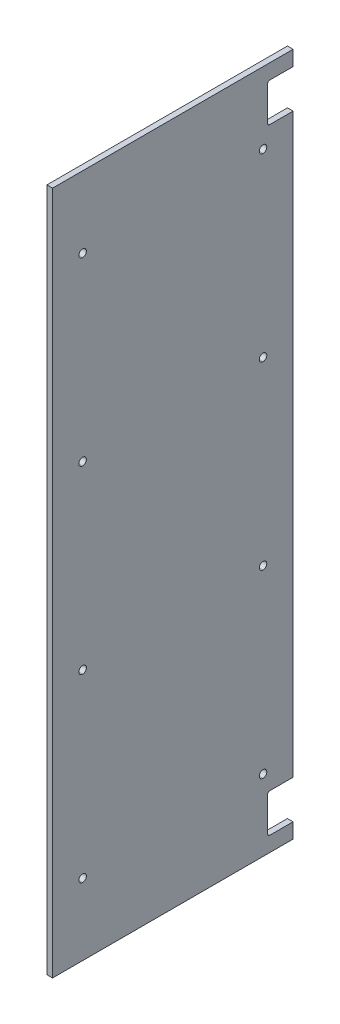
ISO-10303-21;
HEADER;
FILE_DESCRIPTION(('STEP AP214'),'2;1');
FILE_NAME('part.step','',(''),(''),'','','');
FILE_SCHEMA(('AUTOMOTIVE_DESIGN { 1 0 10303 214 1 1 1 1 }'));
ENDSEC;
DATA;
#1=APPLICATION_CONTEXT('core data for automotive mechanical design processes');
#2=APPLICATION_PROTOCOL_DEFINITION('international standard','automotive_design',2000,#1);
#3=PRODUCT_CONTEXT('',#1,'mechanical');
#4=PRODUCT('Part','Part','',(#3));
#5=PRODUCT_RELATED_PRODUCT_CATEGORY('part','',(#4));
#6=PRODUCT_DEFINITION_FORMATION('','',#4);
#7=PRODUCT_DEFINITION_CONTEXT('part definition',#1,'design');
#8=PRODUCT_DEFINITION('design','',#6,#7);
#9=PRODUCT_DEFINITION_SHAPE('','',#8);
#10=(LENGTH_UNIT() NAMED_UNIT(*) SI_UNIT(.MILLI.,.METRE.));
#11=(NAMED_UNIT(*) PLANE_ANGLE_UNIT() SI_UNIT($,.RADIAN.));
#12=(NAMED_UNIT(*) SI_UNIT($,.STERADIAN.) SOLID_ANGLE_UNIT());
#13=UNCERTAINTY_MEASURE_WITH_UNIT(LENGTH_MEASURE(1.E-05),#10,'distance_accuracy_value','');
#14=(GEOMETRIC_REPRESENTATION_CONTEXT(3) GLOBAL_UNCERTAINTY_ASSIGNED_CONTEXT((#13)) GLOBAL_UNIT_ASSIGNED_CONTEXT((#10,
#11,#12)) REPRESENTATION_CONTEXT('',''));
#15=CARTESIAN_POINT('',(0.,0.,0.));
#16=DIRECTION('',(0.,0.,1.));
#17=DIRECTION('',(1.,0.,0.));
#18=AXIS2_PLACEMENT_3D('',#15,#16,#17);
#19=CARTESIAN_POINT('',(-4.76250000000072,577.85,-203.2));
#20=DIRECTION('',(-1.,0.,0.));
#21=DIRECTION('',(0.,0.,1.));
#22=AXIS2_PLACEMENT_3D('',#19,#20,#21);
#23=PLANE('',#22);
#24=DIRECTION('',(0.,0.,-1.));
#25=VECTOR('',#24,1.);
#26=CARTESIAN_POINT('',(-4.76250000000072,577.85,0.));
#27=LINE('',#26,#25);
#28=CARTESIAN_POINT('',(-4.76250000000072,577.85,203.2));
#29=VERTEX_POINT('',#28);
#30=CARTESIAN_POINT('',(-4.76250000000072,577.85,-203.2));
#31=VERTEX_POINT('',#30);
#32=EDGE_CURVE('E231',#29,#31,#27,.T.);
#33=ORIENTED_EDGE('',*,*,#32,.T.);
#34=DIRECTION('',(0.,1.,0.));
#35=VECTOR('',#34,1.);
#36=CARTESIAN_POINT('',(-4.76250000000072,577.85,-203.2));
#37=LINE('',#36,#35);
#38=CARTESIAN_POINT('',(-4.76250000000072,552.449999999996,-203.2));
#39=VERTEX_POINT('',#38);
#40=EDGE_CURVE('E225',#39,#31,#37,.T.);
#41=ORIENTED_EDGE('',*,*,#40,.F.);
#42=DIRECTION('',(0.,0.,1.));
#43=VECTOR('',#42,1.);
#44=CARTESIAN_POINT('',(-4.76250000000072,552.449999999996,-203.2));
#45=LINE('',#44,#43);
#46=CARTESIAN_POINT('',(-4.76250000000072,552.449999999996,-163.5125));
#47=VERTEX_POINT('',#46);
#48=EDGE_CURVE('E228',#39,#47,#45,.T.);
#49=ORIENTED_EDGE('',*,*,#48,.T.);
#50=CARTESIAN_POINT('',(-4.76250000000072,549.274999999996,-163.5125));
#51=DIRECTION('',(1.,0.,0.));
#52=DIRECTION('',(0.,0.,-1.));
#53=AXIS2_PLACEMENT_3D('',#50,#51,#52);
#54=CIRCLE('',#53,3.17500000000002);
#55=CARTESIAN_POINT('',(-4.76250000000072,549.274999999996,-160.3375));
#56=VERTEX_POINT('',#55);
#57=EDGE_CURVE('E424',#47,#56,#54,.T.);
#58=ORIENTED_EDGE('',*,*,#57,.T.);
#59=DIRECTION('',(0.,-1.,0.));
#60=VECTOR('',#59,1.);
#61=CARTESIAN_POINT('',(-4.76250000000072,490.537499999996,-160.3375));
#62=LINE('',#61,#60);
#63=CARTESIAN_POINT('',(-4.76250000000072,490.537499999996,-160.3375));
#64=VERTEX_POINT('',#63);
#65=EDGE_CURVE('E257',#56,#64,#62,.T.);
#66=ORIENTED_EDGE('',*,*,#65,.T.);
#67=CARTESIAN_POINT('',(-4.76250000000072,490.537499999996,-163.5125));
#68=DIRECTION('',(1.,0.,0.));
#69=DIRECTION('',(0.,0.,-1.));
#70=AXIS2_PLACEMENT_3D('',#67,#68,#69);
#71=CIRCLE('',#70,3.175);
#72=CARTESIAN_POINT('',(-4.76250000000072,487.362499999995,-163.5125));
#73=VERTEX_POINT('',#72);
#74=EDGE_CURVE('E266',#64,#73,#71,.T.);
#75=ORIENTED_EDGE('',*,*,#74,.T.);
#76=DIRECTION('',(0.,0.,-1.));
#77=VECTOR('',#76,1.);
#78=CARTESIAN_POINT('',(-4.76250000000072,487.362499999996,-185.7375));
#79=LINE('',#78,#77);
#80=CARTESIAN_POINT('',(-4.76250000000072,487.362499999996,-203.2));
#81=VERTEX_POINT('',#80);
#82=EDGE_CURVE('E263',#73,#81,#79,.T.);
#83=ORIENTED_EDGE('',*,*,#82,.T.);
#84=DIRECTION('',(0.,1.,0.));
#85=VECTOR('',#84,1.);
#86=CARTESIAN_POINT('',(-4.76250000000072,577.85,-203.2));
#87=LINE('',#86,#85);
#88=CARTESIAN_POINT('',(-4.76250000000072,-487.362500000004,-203.2));
#89=VERTEX_POINT('',#88);
#90=EDGE_CURVE('E270',#89,#81,#87,.T.);
#91=ORIENTED_EDGE('',*,*,#90,.F.);
#92=DIRECTION('',(0.,0.,1.));
#93=VECTOR('',#92,1.);
#94=CARTESIAN_POINT('',(-4.76250000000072,-487.362500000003,-185.7375));
#95=LINE('',#94,#93);
#96=CARTESIAN_POINT('',(-4.76250000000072,-487.362500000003,-163.5125));
#97=VERTEX_POINT('',#96);
#98=EDGE_CURVE('E274',#89,#97,#95,.T.);
#99=ORIENTED_EDGE('',*,*,#98,.T.);
#100=CARTESIAN_POINT('',(-4.76250000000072,-490.537500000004,-163.5125));
#101=DIRECTION('',(-1.,0.,0.));
#102=DIRECTION('',(0.,0.,1.));
#103=AXIS2_PLACEMENT_3D('',#100,#101,#102);
#104=CIRCLE('',#103,3.175);
#105=CARTESIAN_POINT('',(-4.76250000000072,-490.537500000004,-160.3375));
#106=VERTEX_POINT('',#105);
#107=EDGE_CURVE('E426',#97,#106,#104,.F.);
#108=ORIENTED_EDGE('',*,*,#107,.T.);
#109=DIRECTION('',(0.,-1.,0.));
#110=VECTOR('',#109,1.);
#111=CARTESIAN_POINT('',(-4.76250000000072,-490.537500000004,-160.3375));
#112=LINE('',#111,#110);
#113=CARTESIAN_POINT('',(-4.76250000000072,-549.275000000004,-160.3375));
#114=VERTEX_POINT('',#113);
#115=EDGE_CURVE('E185',#106,#114,#112,.T.);
#116=ORIENTED_EDGE('',*,*,#115,.T.);
#117=CARTESIAN_POINT('',(-4.76250000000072,-549.275000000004,-163.5125));
#118=DIRECTION('',(-1.,0.,0.));
#119=DIRECTION('',(0.,0.,1.));
#120=AXIS2_PLACEMENT_3D('',#117,#118,#119);
#121=CIRCLE('',#120,3.17500000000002);
#122=CARTESIAN_POINT('',(-4.76250000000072,-552.450000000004,-163.5125));
#123=VERTEX_POINT('',#122);
#124=EDGE_CURVE('E19',#114,#123,#121,.F.);
#125=ORIENTED_EDGE('',*,*,#124,.T.);
#126=DIRECTION('',(0.,0.,-1.));
#127=VECTOR('',#126,1.);
#128=CARTESIAN_POINT('',(-4.76250000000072,-552.450000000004,-203.2));
#129=LINE('',#128,#127);
#130=CARTESIAN_POINT('',(-4.76250000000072,-552.450000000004,-203.2));
#131=VERTEX_POINT('',#130);
#132=EDGE_CURVE('E285',#123,#131,#129,.T.);
#133=ORIENTED_EDGE('',*,*,#132,.T.);
#134=DIRECTION('',(0.,1.,0.));
#135=VECTOR('',#134,1.);
#136=CARTESIAN_POINT('',(-4.76250000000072,577.85,-203.2));
#137=LINE('',#136,#135);
#138=CARTESIAN_POINT('',(-4.76250000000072,-577.85,-203.2));
#139=VERTEX_POINT('',#138);
#140=EDGE_CURVE('E197',#139,#131,#137,.T.);
#141=ORIENTED_EDGE('',*,*,#140,.F.);
#142=DIRECTION('',(0.,0.,-1.));
#143=VECTOR('',#142,1.);
#144=CARTESIAN_POINT('',(-4.76250000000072,-577.85,-203.2));
#145=LINE('',#144,#143);
#146=CARTESIAN_POINT('',(-4.76250000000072,-577.85,203.2));
#147=VERTEX_POINT('',#146);
#148=EDGE_CURVE('E295',#147,#139,#145,.T.);
#149=ORIENTED_EDGE('',*,*,#148,.F.);
#150=DIRECTION('',(0.,1.,0.));
#151=VECTOR('',#150,1.);
#152=CARTESIAN_POINT('',(-4.76250000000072,577.85,203.2));
#153=LINE('',#152,#151);
#154=EDGE_CURVE('E301',#29,#147,#153,.F.);
#155=ORIENTED_EDGE('',*,*,#154,.F.);
#156=EDGE_LOOP('',(#33,#41,#49,#58,#66,#75,#83,#91,#99,#108,#116,#125,#133,#141,#149,#155));
#157=FACE_BOUND('',#156,.T.);
#158=CARTESIAN_POINT('',(-4.76250000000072,-457.200000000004,-152.4));
#159=DIRECTION('',(1.,0.,0.));
#160=DIRECTION('',(0.,1.,0.));
#161=AXIS2_PLACEMENT_3D('',#158,#159,#160);
#162=CIRCLE('',#161,6.35);
#163=CARTESIAN_POINT('',(-4.76250000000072,-463.550000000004,-152.4));
#164=VERTEX_POINT('',#163);
#165=CARTESIAN_POINT('',(-4.76250000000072,-450.850000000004,-152.4));
#166=VERTEX_POINT('',#165);
#167=EDGE_CURVE('E421',#164,#166,#162,.T.);
#168=ORIENTED_EDGE('',*,*,#167,.T.);
#169=CARTESIAN_POINT('',(-4.76250000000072,-457.200000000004,-152.4));
#170=DIRECTION('',(1.,0.,0.));
#171=DIRECTION('',(0.,1.,0.));
#172=AXIS2_PLACEMENT_3D('',#169,#170,#171);
#173=CIRCLE('',#172,6.35);
#174=EDGE_CURVE('E418',#166,#164,#173,.T.);
#175=ORIENTED_EDGE('',*,*,#174,.T.);
#176=EDGE_LOOP('',(#168,#175));
#177=FACE_BOUND('',#176,.T.);
#178=CARTESIAN_POINT('',(-4.76250000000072,-152.400000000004,-152.4));
#179=DIRECTION('',(1.,0.,0.));
#180=DIRECTION('',(0.,1.,0.));
#181=AXIS2_PLACEMENT_3D('',#178,#179,#180);
#182=CIRCLE('',#181,6.35);
#183=CARTESIAN_POINT('',(-4.76250000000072,-158.750000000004,-152.4));
#184=VERTEX_POINT('',#183);
#185=CARTESIAN_POINT('',(-4.76250000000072,-146.050000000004,-152.4));
#186=VERTEX_POINT('',#185);
#187=EDGE_CURVE('E415',#184,#186,#182,.T.);
#188=ORIENTED_EDGE('',*,*,#187,.T.);
#189=CARTESIAN_POINT('',(-4.76250000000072,-152.400000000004,-152.4));
#190=DIRECTION('',(1.,0.,0.));
#191=DIRECTION('',(0.,1.,0.));
#192=AXIS2_PLACEMENT_3D('',#189,#190,#191);
#193=CIRCLE('',#192,6.35);
#194=EDGE_CURVE('E412',#186,#184,#193,.T.);
#195=ORIENTED_EDGE('',*,*,#194,.T.);
#196=EDGE_LOOP('',(#188,#195));
#197=FACE_BOUND('',#196,.T.);
#198=CARTESIAN_POINT('',(-4.76250000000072,152.400000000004,-152.4));
#199=DIRECTION('',(-1.,0.,0.));
#200=DIRECTION('',(0.,-1.,0.));
#201=AXIS2_PLACEMENT_3D('',#198,#199,#200);
#202=CIRCLE('',#201,6.35);
#203=CARTESIAN_POINT('',(-4.76250000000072,158.750000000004,-152.4));
#204=VERTEX_POINT('',#203);
#205=CARTESIAN_POINT('',(-4.76250000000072,146.050000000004,-152.4));
#206=VERTEX_POINT('',#205);
#207=EDGE_CURVE('E409',#204,#206,#202,.F.);
#208=ORIENTED_EDGE('',*,*,#207,.T.);
#209=CARTESIAN_POINT('',(-4.76250000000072,152.400000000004,-152.4));
#210=DIRECTION('',(-1.,0.,0.));
#211=DIRECTION('',(0.,-1.,0.));
#212=AXIS2_PLACEMENT_3D('',#209,#210,#211);
#213=CIRCLE('',#212,6.35);
#214=EDGE_CURVE('E406',#206,#204,#213,.F.);
#215=ORIENTED_EDGE('',*,*,#214,.T.);
#216=EDGE_LOOP('',(#208,#215));
#217=FACE_BOUND('',#216,.T.);
#218=CARTESIAN_POINT('',(-4.76250000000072,457.200000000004,-152.4));
#219=DIRECTION('',(-1.,0.,0.));
#220=DIRECTION('',(0.,-1.,0.));
#221=AXIS2_PLACEMENT_3D('',#218,#219,#220);
#222=CIRCLE('',#221,6.35);
#223=CARTESIAN_POINT('',(-4.76250000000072,463.550000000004,-152.4));
#224=VERTEX_POINT('',#223);
#225=CARTESIAN_POINT('',(-4.76250000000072,450.850000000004,-152.4));
#226=VERTEX_POINT('',#225);
#227=EDGE_CURVE('E403',#224,#226,#222,.F.);
#228=ORIENTED_EDGE('',*,*,#227,.T.);
#229=CARTESIAN_POINT('',(-4.76250000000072,457.200000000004,-152.4));
#230=DIRECTION('',(-1.,0.,0.));
#231=DIRECTION('',(0.,-1.,0.));
#232=AXIS2_PLACEMENT_3D('',#229,#230,#231);
#233=CIRCLE('',#232,6.35);
#234=EDGE_CURVE('E400',#226,#224,#233,.F.);
#235=ORIENTED_EDGE('',*,*,#234,.T.);
#236=EDGE_LOOP('',(#228,#235));
#237=FACE_BOUND('',#236,.T.);
#238=CARTESIAN_POINT('',(-4.76250000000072,-457.200000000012,152.4));
#239=DIRECTION('',(-1.,0.,0.));
#240=DIRECTION('',(0.,0.,1.));
#241=AXIS2_PLACEMENT_3D('',#238,#239,#240);
#242=CIRCLE('',#241,6.35);
#243=CARTESIAN_POINT('',(-4.76250000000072,-450.850000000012,152.4));
#244=VERTEX_POINT('',#243);
#245=CARTESIAN_POINT('',(-4.76250000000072,-463.550000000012,152.4));
#246=VERTEX_POINT('',#245);
#247=EDGE_CURVE('E397',#244,#246,#242,.F.);
#248=ORIENTED_EDGE('',*,*,#247,.T.);
#249=CARTESIAN_POINT('',(-4.76250000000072,-457.200000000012,152.4));
#250=DIRECTION('',(-1.,0.,0.));
#251=DIRECTION('',(0.,0.,1.));
#252=AXIS2_PLACEMENT_3D('',#249,#250,#251);
#253=CIRCLE('',#252,6.35);
#254=EDGE_CURVE('E394',#246,#244,#253,.F.);
#255=ORIENTED_EDGE('',*,*,#254,.T.);
#256=EDGE_LOOP('',(#248,#255));
#257=FACE_BOUND('',#256,.T.);
#258=CARTESIAN_POINT('',(-4.76250000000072,-152.400000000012,152.4));
#259=DIRECTION('',(-1.,0.,0.));
#260=DIRECTION('',(0.,0.,1.));
#261=AXIS2_PLACEMENT_3D('',#258,#259,#260);
#262=CIRCLE('',#261,6.35);
#263=CARTESIAN_POINT('',(-4.76250000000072,-146.050000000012,152.4));
#264=VERTEX_POINT('',#263);
#265=CARTESIAN_POINT('',(-4.76250000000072,-158.750000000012,152.4));
#266=VERTEX_POINT('',#265);
#267=EDGE_CURVE('E391',#264,#266,#262,.F.);
#268=ORIENTED_EDGE('',*,*,#267,.T.);
#269=CARTESIAN_POINT('',(-4.76250000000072,-152.400000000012,152.4));
#270=DIRECTION('',(-1.,0.,0.));
#271=DIRECTION('',(0.,0.,1.));
#272=AXIS2_PLACEMENT_3D('',#269,#270,#271);
#273=CIRCLE('',#272,6.35);
#274=EDGE_CURVE('E388',#266,#264,#273,.F.);
#275=ORIENTED_EDGE('',*,*,#274,.T.);
#276=EDGE_LOOP('',(#268,#275));
#277=FACE_BOUND('',#276,.T.);
#278=CARTESIAN_POINT('',(-4.76250000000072,152.400000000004,152.4));
#279=DIRECTION('',(1.,0.,0.));
#280=DIRECTION('',(0.,0.,-1.));
#281=AXIS2_PLACEMENT_3D('',#278,#279,#280);
#282=CIRCLE('',#281,6.35);
#283=CARTESIAN_POINT('',(-4.76250000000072,146.050000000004,152.4));
#284=VERTEX_POINT('',#283);
#285=CARTESIAN_POINT('',(-4.76250000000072,158.750000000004,152.4));
#286=VERTEX_POINT('',#285);
#287=EDGE_CURVE('E384',#284,#286,#282,.T.);
#288=ORIENTED_EDGE('',*,*,#287,.T.);
#289=CARTESIAN_POINT('',(-4.76250000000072,152.400000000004,152.4));
#290=DIRECTION('',(1.,0.,0.));
#291=DIRECTION('',(0.,0.,-1.));
#292=AXIS2_PLACEMENT_3D('',#289,#290,#291);
#293=CIRCLE('',#292,6.35);
#294=EDGE_CURVE('E380',#286,#284,#293,.T.);
#295=ORIENTED_EDGE('',*,*,#294,.T.);
#296=EDGE_LOOP('',(#288,#295));
#297=FACE_BOUND('',#296,.T.);
#298=CARTESIAN_POINT('',(-4.76250000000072,457.200000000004,152.4));
#299=DIRECTION('',(1.,0.,0.));
#300=DIRECTION('',(0.,0.,-1.));
#301=AXIS2_PLACEMENT_3D('',#298,#299,#300);
#302=CIRCLE('',#301,6.35);
#303=CARTESIAN_POINT('',(-4.76250000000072,450.850000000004,152.4));
#304=VERTEX_POINT('',#303);
#305=CARTESIAN_POINT('',(-4.76250000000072,463.550000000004,152.4));
#306=VERTEX_POINT('',#305);
#307=EDGE_CURVE('E377',#304,#306,#302,.T.);
#308=ORIENTED_EDGE('',*,*,#307,.T.);
#309=CARTESIAN_POINT('',(-4.76250000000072,457.200000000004,152.4));
#310=DIRECTION('',(1.,0.,0.));
#311=DIRECTION('',(0.,0.,-1.));
#312=AXIS2_PLACEMENT_3D('',#309,#310,#311);
#313=CIRCLE('',#312,6.35);
#314=EDGE_CURVE('E375',#306,#304,#313,.T.);
#315=ORIENTED_EDGE('',*,*,#314,.T.);
#316=EDGE_LOOP('',(#308,#315));
#317=FACE_BOUND('',#316,.T.);
#318=ADVANCED_FACE('F16',(#157,#177,#197,#217,#237,#257,#277,#297,#317),#23,.T.);
#319=CARTESIAN_POINT('',(-32.4150677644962,552.449999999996,-203.2));
#320=DIRECTION('',(0.,1.,0.));
#321=DIRECTION('',(0.,0.,1.));
#322=AXIS2_PLACEMENT_3D('',#319,#320,#321);
#323=PLANE('',#322);
#324=DIRECTION('',(-1.,0.,0.));
#325=VECTOR('',#324,1.);
#326=CARTESIAN_POINT('',(4.76249999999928,552.449999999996,-203.2));
#327=LINE('',#326,#325);
#328=CARTESIAN_POINT('',(4.76249999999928,552.449999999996,-203.2));
#329=VERTEX_POINT('',#328);
#330=EDGE_CURVE('E235',#329,#39,#327,.T.);
#331=ORIENTED_EDGE('',*,*,#330,.F.);
#332=DIRECTION('',(0.,0.,-1.));
#333=VECTOR('',#332,1.);
#334=CARTESIAN_POINT('',(4.76249999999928,552.449999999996,203.2));
#335=LINE('',#334,#333);
#336=CARTESIAN_POINT('',(4.76249999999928,552.449999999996,-163.5125));
#337=VERTEX_POINT('',#336);
#338=EDGE_CURVE('E473',#337,#329,#335,.T.);
#339=ORIENTED_EDGE('',*,*,#338,.F.);
#340=DIRECTION('',(1.,0.,0.));
#341=VECTOR('',#340,1.);
#342=CARTESIAN_POINT('',(-4.76250000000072,552.449999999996,-163.5125));
#343=LINE('',#342,#341);
#344=EDGE_CURVE('E241',#337,#47,#343,.F.);
#345=ORIENTED_EDGE('',*,*,#344,.T.);
#346=ORIENTED_EDGE('',*,*,#48,.F.);
#347=EDGE_LOOP('',(#331,#339,#345,#346));
#348=FACE_BOUND('',#347,.T.);
#349=ADVANCED_FACE('F238',(#348),#323,.F.);
#350=CARTESIAN_POINT('',(4.76249999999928,577.85,-203.2));
#351=DIRECTION('',(0.,0.,-1.));
#352=DIRECTION('',(-1.,0.,0.));
#353=AXIS2_PLACEMENT_3D('',#350,#351,#352);
#354=PLANE('',#353);
#355=DIRECTION('',(0.,1.,0.));
#356=VECTOR('',#355,1.);
#357=CARTESIAN_POINT('',(4.76249999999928,577.85,-203.2));
#358=LINE('',#357,#356);
#359=CARTESIAN_POINT('',(4.76249999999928,577.85,-203.2));
#360=VERTEX_POINT('',#359);
#361=EDGE_CURVE('E246',#329,#360,#358,.T.);
#362=ORIENTED_EDGE('',*,*,#361,.F.);
#363=ORIENTED_EDGE('',*,*,#330,.T.);
#364=ORIENTED_EDGE('',*,*,#40,.T.);
#365=DIRECTION('',(1.,0.,0.));
#366=VECTOR('',#365,1.);
#367=CARTESIAN_POINT('',(-7.93750000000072,577.85,-203.2));
#368=LINE('',#367,#366);
#369=EDGE_CURVE('E248',#31,#360,#368,.T.);
#370=ORIENTED_EDGE('',*,*,#369,.T.);
#371=EDGE_LOOP('',(#362,#363,#364,#370));
#372=FACE_BOUND('',#371,.T.);
#373=ADVANCED_FACE('F244',(#372),#354,.T.);
#374=CARTESIAN_POINT('',(-7.93750000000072,577.85,0.));
#375=DIRECTION('',(0.,-1.,0.));
#376=DIRECTION('',(0.,0.,-1.));
#377=AXIS2_PLACEMENT_3D('',#374,#375,#376);
#378=PLANE('',#377);
#379=DIRECTION('',(1.,0.,0.));
#380=VECTOR('',#379,1.);
#381=CARTESIAN_POINT('',(-20.6375000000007,577.85,203.2));
#382=LINE('',#381,#380);
#383=CARTESIAN_POINT('',(4.76249999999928,577.85,203.2));
#384=VERTEX_POINT('',#383);
#385=EDGE_CURVE('E298',#384,#29,#382,.F.);
#386=ORIENTED_EDGE('',*,*,#385,.F.);
#387=DIRECTION('',(0.,0.,-1.));
#388=VECTOR('',#387,1.);
#389=CARTESIAN_POINT('',(4.76249999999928,577.85,203.2));
#390=LINE('',#389,#388);
#391=EDGE_CURVE('E461',#360,#384,#390,.F.);
#392=ORIENTED_EDGE('',*,*,#391,.F.);
#393=ORIENTED_EDGE('',*,*,#369,.F.);
#394=ORIENTED_EDGE('',*,*,#32,.F.);
#395=EDGE_LOOP('',(#386,#392,#393,#394));
#396=FACE_BOUND('',#395,.T.);
#397=ADVANCED_FACE('F808',(#396),#378,.F.);
#398=CARTESIAN_POINT('',(-20.6375000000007,577.85,203.2));
#399=DIRECTION('',(0.,0.,1.));
#400=DIRECTION('',(1.,0.,0.));
#401=AXIS2_PLACEMENT_3D('',#398,#399,#400);
#402=PLANE('',#401);
#403=DIRECTION('',(0.,1.,0.));
#404=VECTOR('',#403,1.);
#405=CARTESIAN_POINT('',(4.76249999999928,577.85,203.2));
#406=LINE('',#405,#404);
#407=CARTESIAN_POINT('',(4.76249999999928,-577.85,203.2));
#408=VERTEX_POINT('',#407);
#409=EDGE_CURVE('E451',#384,#408,#406,.F.);
#410=ORIENTED_EDGE('',*,*,#409,.F.);
#411=ORIENTED_EDGE('',*,*,#385,.T.);
#412=ORIENTED_EDGE('',*,*,#154,.T.);
#413=DIRECTION('',(1.,0.,0.));
#414=VECTOR('',#413,1.);
#415=CARTESIAN_POINT('',(-20.6375000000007,-577.85,203.2));
#416=LINE('',#415,#414);
#417=EDGE_CURVE('E292',#408,#147,#416,.F.);
#418=ORIENTED_EDGE('',*,*,#417,.F.);
#419=EDGE_LOOP('',(#410,#411,#412,#418));
#420=FACE_BOUND('',#419,.T.);
#421=ADVANCED_FACE('F800',(#420),#402,.T.);
#422=CARTESIAN_POINT('',(-20.6375000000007,-577.85,-203.2));
#423=DIRECTION('',(0.,-1.,0.));
#424=DIRECTION('',(0.,0.,-1.));
#425=AXIS2_PLACEMENT_3D('',#422,#423,#424);
#426=PLANE('',#425);
#427=DIRECTION('',(0.,0.,-1.));
#428=VECTOR('',#427,1.);
#429=CARTESIAN_POINT('',(4.76249999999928,-577.85,203.2));
#430=LINE('',#429,#428);
#431=CARTESIAN_POINT('',(4.76249999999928,-577.85,-203.2));
#432=VERTEX_POINT('',#431);
#433=EDGE_CURVE('E443',#408,#432,#430,.T.);
#434=ORIENTED_EDGE('',*,*,#433,.F.);
#435=ORIENTED_EDGE('',*,*,#417,.T.);
#436=ORIENTED_EDGE('',*,*,#148,.T.);
#437=DIRECTION('',(-1.,0.,0.));
#438=VECTOR('',#437,1.);
#439=CARTESIAN_POINT('',(4.76249999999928,-577.85,-203.2));
#440=LINE('',#439,#438);
#441=EDGE_CURVE('E291',#432,#139,#440,.T.);
#442=ORIENTED_EDGE('',*,*,#441,.F.);
#443=EDGE_LOOP('',(#434,#435,#436,#442));
#444=FACE_BOUND('',#443,.T.);
#445=ADVANCED_FACE('F793',(#444),#426,.T.);
#446=CARTESIAN_POINT('',(4.76249999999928,577.85,-203.2));
#447=DIRECTION('',(0.,0.,-1.));
#448=DIRECTION('',(-1.,0.,0.));
#449=AXIS2_PLACEMENT_3D('',#446,#447,#448);
#450=PLANE('',#449);
#451=DIRECTION('',(0.,1.,0.));
#452=VECTOR('',#451,1.);
#453=CARTESIAN_POINT('',(4.76249999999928,577.85,-203.2));
#454=LINE('',#453,#452);
#455=CARTESIAN_POINT('',(4.76249999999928,-552.450000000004,-203.2));
#456=VERTEX_POINT('',#455);
#457=EDGE_CURVE('E440',#432,#456,#454,.T.);
#458=ORIENTED_EDGE('',*,*,#457,.F.);
#459=ORIENTED_EDGE('',*,*,#441,.T.);
#460=ORIENTED_EDGE('',*,*,#140,.T.);
#461=DIRECTION('',(1.,0.,0.));
#462=VECTOR('',#461,1.);
#463=CARTESIAN_POINT('',(-32.4150677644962,-552.450000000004,-203.2));
#464=LINE('',#463,#462);
#465=EDGE_CURVE('E287',#131,#456,#464,.T.);
#466=ORIENTED_EDGE('',*,*,#465,.T.);
#467=EDGE_LOOP('',(#458,#459,#460,#466));
#468=FACE_BOUND('',#467,.T.);
#469=ADVANCED_FACE('F786',(#468),#450,.T.);
#470=CARTESIAN_POINT('',(-32.4150677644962,-552.450000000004,-203.2));
#471=DIRECTION('',(0.,-1.,0.));
#472=DIRECTION('',(0.,0.,-1.));
#473=AXIS2_PLACEMENT_3D('',#470,#471,#472);
#474=PLANE('',#473);
#475=DIRECTION('',(-1.,0.,0.));
#476=VECTOR('',#475,1.);
#477=CARTESIAN_POINT('',(-4.76250000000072,-552.450000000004,-163.5125));
#478=LINE('',#477,#476);
#479=CARTESIAN_POINT('',(4.76249999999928,-552.450000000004,-163.5125));
#480=VERTEX_POINT('',#479);
#481=EDGE_CURVE('E284',#123,#480,#478,.F.);
#482=ORIENTED_EDGE('',*,*,#481,.T.);
#483=DIRECTION('',(0.,0.,-1.));
#484=VECTOR('',#483,1.);
#485=CARTESIAN_POINT('',(4.76249999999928,-552.450000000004,203.2));
#486=LINE('',#485,#484);
#487=EDGE_CURVE('E374',#456,#480,#486,.F.);
#488=ORIENTED_EDGE('',*,*,#487,.F.);
#489=ORIENTED_EDGE('',*,*,#465,.F.);
#490=ORIENTED_EDGE('',*,*,#132,.F.);
#491=EDGE_LOOP('',(#482,#488,#489,#490));
#492=FACE_BOUND('',#491,.T.);
#493=ADVANCED_FACE('F550',(#492),#474,.F.);
#494=CARTESIAN_POINT('',(-4.76250000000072,-549.275000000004,-163.5125));
#495=DIRECTION('',(-1.,0.,0.));
#496=DIRECTION('',(0.,0.,1.));
#497=AXIS2_PLACEMENT_3D('',#494,#495,#496);
#498=CYLINDRICAL_SURFACE('',#497,3.17500000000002);
#499=ORIENTED_EDGE('',*,*,#481,.F.);
#500=ORIENTED_EDGE('',*,*,#124,.F.);
#501=DIRECTION('',(1.,0.,0.));
#502=VECTOR('',#501,1.);
#503=CARTESIAN_POINT('',(-4.76250000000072,-549.275000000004,-160.3375));
#504=LINE('',#503,#502);
#505=CARTESIAN_POINT('',(4.76249999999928,-549.275000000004,-160.3375));
#506=VERTEX_POINT('',#505);
#507=EDGE_CURVE('E283',#114,#506,#504,.T.);
#508=ORIENTED_EDGE('',*,*,#507,.T.);
#509=CARTESIAN_POINT('',(4.76249999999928,-549.275000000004,-163.5125));
#510=DIRECTION('',(-1.,0.,0.));
#511=DIRECTION('',(0.,0.,1.));
#512=AXIS2_PLACEMENT_3D('',#509,#510,#511);
#513=CIRCLE('',#512,3.17500000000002);
#514=EDGE_CURVE('E371',#480,#506,#513,.T.);
#515=ORIENTED_EDGE('',*,*,#514,.F.);
#516=EDGE_LOOP('',(#499,#500,#508,#515));
#517=FACE_BOUND('',#516,.T.);
#518=ADVANCED_FACE('F773',(#517),#498,.F.);
#519=CARTESIAN_POINT('',(-4.76250000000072,-490.537500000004,-160.3375));
#520=DIRECTION('',(0.,0.,1.));
#521=DIRECTION('',(0.,-1.,0.));
#522=AXIS2_PLACEMENT_3D('',#519,#520,#521);
#523=PLANE('',#522);
#524=ORIENTED_EDGE('',*,*,#507,.F.);
#525=ORIENTED_EDGE('',*,*,#115,.F.);
#526=DIRECTION('',(-1.,0.,0.));
#527=VECTOR('',#526,1.);
#528=CARTESIAN_POINT('',(-4.76250000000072,-490.537500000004,-160.3375));
#529=LINE('',#528,#527);
#530=CARTESIAN_POINT('',(4.76249999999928,-490.537500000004,-160.3375));
#531=VERTEX_POINT('',#530);
#532=EDGE_CURVE('E427',#106,#531,#529,.F.);
#533=ORIENTED_EDGE('',*,*,#532,.T.);
#534=DIRECTION('',(0.,1.,0.));
#535=VECTOR('',#534,1.);
#536=CARTESIAN_POINT('',(4.76249999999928,577.85,-160.3375));
#537=LINE('',#536,#535);
#538=EDGE_CURVE('E370',#506,#531,#537,.T.);
#539=ORIENTED_EDGE('',*,*,#538,.F.);
#540=EDGE_LOOP('',(#524,#525,#533,#539));
#541=FACE_BOUND('',#540,.T.);
#542=ADVANCED_FACE('F766',(#541),#523,.F.);
#543=CARTESIAN_POINT('',(-4.76250000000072,-490.537500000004,-163.5125));
#544=DIRECTION('',(-1.,0.,0.));
#545=DIRECTION('',(0.,0.,1.));
#546=AXIS2_PLACEMENT_3D('',#543,#544,#545);
#547=CYLINDRICAL_SURFACE('',#546,3.175);
#548=ORIENTED_EDGE('',*,*,#532,.F.);
#549=ORIENTED_EDGE('',*,*,#107,.F.);
#550=DIRECTION('',(1.,0.,0.));
#551=VECTOR('',#550,1.);
#552=CARTESIAN_POINT('',(-32.4150677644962,-487.362500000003,-163.5125));
#553=LINE('',#552,#551);
#554=CARTESIAN_POINT('',(4.76249999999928,-487.362500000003,-163.5125));
#555=VERTEX_POINT('',#554);
#556=EDGE_CURVE('E279',#97,#555,#553,.T.);
#557=ORIENTED_EDGE('',*,*,#556,.T.);
#558=CARTESIAN_POINT('',(4.76249999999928,-490.537500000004,-163.5125));
#559=DIRECTION('',(-1.,0.,0.));
#560=DIRECTION('',(0.,0.,1.));
#561=AXIS2_PLACEMENT_3D('',#558,#559,#560);
#562=CIRCLE('',#561,3.175);
#563=EDGE_CURVE('E366',#531,#555,#562,.T.);
#564=ORIENTED_EDGE('',*,*,#563,.F.);
#565=EDGE_LOOP('',(#548,#549,#557,#564));
#566=FACE_BOUND('',#565,.T.);
#567=ADVANCED_FACE('F530',(#566),#547,.F.);
#568=CARTESIAN_POINT('',(-32.4150677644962,-487.362500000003,-185.7375));
#569=DIRECTION('',(0.,1.,0.));
#570=DIRECTION('',(0.,0.,1.));
#571=AXIS2_PLACEMENT_3D('',#568,#569,#570);
#572=PLANE('',#571);
#573=DIRECTION('',(-1.,0.,0.));
#574=VECTOR('',#573,1.);
#575=CARTESIAN_POINT('',(4.76249999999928,-487.362500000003,-203.2));
#576=LINE('',#575,#574);
#577=CARTESIAN_POINT('',(4.76249999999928,-487.362500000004,-203.2));
#578=VERTEX_POINT('',#577);
#579=EDGE_CURVE('E273',#578,#89,#576,.T.);
#580=ORIENTED_EDGE('',*,*,#579,.F.);
#581=DIRECTION('',(0.,0.,-1.));
#582=VECTOR('',#581,1.);
#583=CARTESIAN_POINT('',(4.76249999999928,-487.362500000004,203.2));
#584=LINE('',#583,#582);
#585=EDGE_CURVE('E369',#555,#578,#584,.T.);
#586=ORIENTED_EDGE('',*,*,#585,.F.);
#587=ORIENTED_EDGE('',*,*,#556,.F.);
#588=ORIENTED_EDGE('',*,*,#98,.F.);
#589=EDGE_LOOP('',(#580,#586,#587,#588));
#590=FACE_BOUND('',#589,.T.);
#591=ADVANCED_FACE('F536',(#590),#572,.F.);
#592=CARTESIAN_POINT('',(4.76249999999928,577.85,-203.2));
#593=DIRECTION('',(0.,0.,-1.));
#594=DIRECTION('',(-1.,0.,0.));
#595=AXIS2_PLACEMENT_3D('',#592,#593,#594);
#596=PLANE('',#595);
#597=DIRECTION('',(0.,1.,0.));
#598=VECTOR('',#597,1.);
#599=CARTESIAN_POINT('',(4.76249999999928,577.85,-203.2));
#600=LINE('',#599,#598);
#601=CARTESIAN_POINT('',(4.76249999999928,487.362499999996,-203.2));
#602=VERTEX_POINT('',#601);
#603=EDGE_CURVE('E517',#578,#602,#600,.T.);
#604=ORIENTED_EDGE('',*,*,#603,.F.);
#605=ORIENTED_EDGE('',*,*,#579,.T.);
#606=ORIENTED_EDGE('',*,*,#90,.T.);
#607=DIRECTION('',(1.,0.,0.));
#608=VECTOR('',#607,1.);
#609=CARTESIAN_POINT('',(-32.4150677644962,487.362499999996,-203.2));
#610=LINE('',#609,#608);
#611=EDGE_CURVE('E267',#81,#602,#610,.T.);
#612=ORIENTED_EDGE('',*,*,#611,.T.);
#613=EDGE_LOOP('',(#604,#605,#606,#612));
#614=FACE_BOUND('',#613,.T.);
#615=ADVANCED_FACE('F561',(#614),#596,.T.);
#616=CARTESIAN_POINT('',(-32.4150677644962,487.362499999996,-185.7375));
#617=DIRECTION('',(0.,-1.,0.));
#618=DIRECTION('',(0.,0.,-1.));
#619=AXIS2_PLACEMENT_3D('',#616,#617,#618);
#620=PLANE('',#619);
#621=DIRECTION('',(1.,0.,0.));
#622=VECTOR('',#621,1.);
#623=CARTESIAN_POINT('',(-4.76250000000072,487.362499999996,-163.5125));
#624=LINE('',#623,#622);
#625=CARTESIAN_POINT('',(4.76249999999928,487.362499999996,-163.5125));
#626=VERTEX_POINT('',#625);
#627=EDGE_CURVE('E259',#73,#626,#624,.T.);
#628=ORIENTED_EDGE('',*,*,#627,.T.);
#629=DIRECTION('',(0.,0.,-1.));
#630=VECTOR('',#629,1.);
#631=CARTESIAN_POINT('',(4.76249999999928,487.362499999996,203.2));
#632=LINE('',#631,#630);
#633=EDGE_CURVE('E365',#602,#626,#632,.F.);
#634=ORIENTED_EDGE('',*,*,#633,.F.);
#635=ORIENTED_EDGE('',*,*,#611,.F.);
#636=ORIENTED_EDGE('',*,*,#82,.F.);
#637=EDGE_LOOP('',(#628,#634,#635,#636));
#638=FACE_BOUND('',#637,.T.);
#639=ADVANCED_FACE('F565',(#638),#620,.F.);
#640=CARTESIAN_POINT('',(-4.76250000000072,490.537499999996,-163.5125));
#641=DIRECTION('',(1.,0.,0.));
#642=DIRECTION('',(0.,0.,-1.));
#643=AXIS2_PLACEMENT_3D('',#640,#641,#642);
#644=CYLINDRICAL_SURFACE('',#643,3.175);
#645=ORIENTED_EDGE('',*,*,#627,.F.);
#646=ORIENTED_EDGE('',*,*,#74,.F.);
#647=DIRECTION('',(1.,0.,0.));
#648=VECTOR('',#647,1.);
#649=CARTESIAN_POINT('',(-4.76250000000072,490.537499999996,-160.3375));
#650=LINE('',#649,#648);
#651=CARTESIAN_POINT('',(4.76249999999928,490.537499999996,-160.3375));
#652=VERTEX_POINT('',#651);
#653=EDGE_CURVE('E258',#64,#652,#650,.T.);
#654=ORIENTED_EDGE('',*,*,#653,.T.);
#655=CARTESIAN_POINT('',(4.76249999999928,490.537499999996,-163.5125));
#656=DIRECTION('',(1.,0.,0.));
#657=DIRECTION('',(0.,0.,-1.));
#658=AXIS2_PLACEMENT_3D('',#655,#656,#657);
#659=CIRCLE('',#658,3.175);
#660=EDGE_CURVE('E362',#626,#652,#659,.F.);
#661=ORIENTED_EDGE('',*,*,#660,.F.);
#662=EDGE_LOOP('',(#645,#646,#654,#661));
#663=FACE_BOUND('',#662,.T.);
#664=ADVANCED_FACE('F583',(#663),#644,.F.);
#665=CARTESIAN_POINT('',(-4.76250000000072,490.537499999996,-160.3375));
#666=DIRECTION('',(0.,0.,1.));
#667=DIRECTION('',(0.,-1.,0.));
#668=AXIS2_PLACEMENT_3D('',#665,#666,#667);
#669=PLANE('',#668);
#670=ORIENTED_EDGE('',*,*,#653,.F.);
#671=ORIENTED_EDGE('',*,*,#65,.F.);
#672=DIRECTION('',(1.,0.,0.));
#673=VECTOR('',#672,1.);
#674=CARTESIAN_POINT('',(-4.76250000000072,549.274999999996,-160.3375));
#675=LINE('',#674,#673);
#676=CARTESIAN_POINT('',(4.76249999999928,549.274999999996,-160.3375));
#677=VERTEX_POINT('',#676);
#678=EDGE_CURVE('E423',#56,#677,#675,.T.);
#679=ORIENTED_EDGE('',*,*,#678,.T.);
#680=DIRECTION('',(0.,1.,0.));
#681=VECTOR('',#680,1.);
#682=CARTESIAN_POINT('',(4.76249999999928,577.85,-160.3375));
#683=LINE('',#682,#681);
#684=EDGE_CURVE('E361',#652,#677,#683,.T.);
#685=ORIENTED_EDGE('',*,*,#684,.F.);
#686=EDGE_LOOP('',(#670,#671,#679,#685));
#687=FACE_BOUND('',#686,.T.);
#688=ADVANCED_FACE('F576',(#687),#669,.F.);
#689=CARTESIAN_POINT('',(-4.76250000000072,549.274999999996,-163.5125));
#690=DIRECTION('',(1.,0.,0.));
#691=DIRECTION('',(0.,0.,-1.));
#692=AXIS2_PLACEMENT_3D('',#689,#690,#691);
#693=CYLINDRICAL_SURFACE('',#692,3.17500000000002);
#694=ORIENTED_EDGE('',*,*,#678,.F.);
#695=ORIENTED_EDGE('',*,*,#57,.F.);
#696=ORIENTED_EDGE('',*,*,#344,.F.);
#697=CARTESIAN_POINT('',(4.76249999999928,549.274999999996,-163.5125));
#698=DIRECTION('',(1.,0.,0.));
#699=DIRECTION('',(0.,0.,-1.));
#700=AXIS2_PLACEMENT_3D('',#697,#698,#699);
#701=CIRCLE('',#700,3.17500000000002);
#702=EDGE_CURVE('E358',#677,#337,#701,.F.);
#703=ORIENTED_EDGE('',*,*,#702,.F.);
#704=EDGE_LOOP('',(#694,#695,#696,#703));
#705=FACE_BOUND('',#704,.T.);
#706=ADVANCED_FACE('F580',(#705),#693,.F.);
#707=CARTESIAN_POINT('',(-13.0175000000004,-457.200000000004,-152.4));
#708=DIRECTION('',(1.,0.,0.));
#709=DIRECTION('',(0.,1.,0.));
#710=AXIS2_PLACEMENT_3D('',#707,#708,#709);
#711=CYLINDRICAL_SURFACE('',#710,6.35);
#712=ORIENTED_EDGE('',*,*,#167,.F.);
#713=DIRECTION('',(1.,0.,0.));
#714=VECTOR('',#713,1.);
#715=CARTESIAN_POINT('',(-13.0175000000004,-463.550000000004,-152.4));
#716=LINE('',#715,#714);
#717=CARTESIAN_POINT('',(4.7625,-463.550000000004,-152.4));
#718=VERTEX_POINT('',#717);
#719=EDGE_CURVE('E420',#164,#718,#716,.T.);
#720=ORIENTED_EDGE('',*,*,#719,.T.);
#721=CARTESIAN_POINT('',(4.76250000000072,-457.200000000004,-152.4));
#722=DIRECTION('',(1.,0.,0.));
#723=DIRECTION('',(0.,1.,0.));
#724=AXIS2_PLACEMENT_3D('',#721,#722,#723);
#725=CIRCLE('',#724,6.35);
#726=CARTESIAN_POINT('',(4.7625,-450.850000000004,-152.4));
#727=VERTEX_POINT('',#726);
#728=EDGE_CURVE('E355',#727,#718,#725,.F.);
#729=ORIENTED_EDGE('',*,*,#728,.F.);
#730=DIRECTION('',(1.,0.,0.));
#731=VECTOR('',#730,1.);
#732=CARTESIAN_POINT('',(-13.0175000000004,-450.850000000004,-152.4));
#733=LINE('',#732,#731);
#734=EDGE_CURVE('E417',#727,#166,#733,.F.);
#735=ORIENTED_EDGE('',*,*,#734,.T.);
#736=EDGE_LOOP('',(#712,#720,#729,#735));
#737=FACE_BOUND('',#736,.T.);
#738=ADVANCED_FACE('F658',(#737),#711,.F.);
#739=CARTESIAN_POINT('',(-13.0175000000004,-457.200000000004,-152.4));
#740=DIRECTION('',(1.,0.,0.));
#741=DIRECTION('',(0.,1.,0.));
#742=AXIS2_PLACEMENT_3D('',#739,#740,#741);
#743=CYLINDRICAL_SURFACE('',#742,6.35);
#744=CARTESIAN_POINT('',(4.76249999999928,-457.200000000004,-152.4));
#745=DIRECTION('',(1.,0.,0.));
#746=DIRECTION('',(0.,1.,0.));
#747=AXIS2_PLACEMENT_3D('',#744,#745,#746);
#748=CIRCLE('',#747,6.35);
#749=EDGE_CURVE('E352',#718,#727,#748,.F.);
#750=ORIENTED_EDGE('',*,*,#749,.F.);
#751=ORIENTED_EDGE('',*,*,#719,.F.);
#752=ORIENTED_EDGE('',*,*,#174,.F.);
#753=ORIENTED_EDGE('',*,*,#734,.F.);
#754=EDGE_LOOP('',(#750,#751,#752,#753));
#755=FACE_BOUND('',#754,.T.);
#756=ADVANCED_FACE('F654',(#755),#743,.F.);
#757=CARTESIAN_POINT('',(-13.0175000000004,-152.400000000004,-152.4));
#758=DIRECTION('',(1.,0.,0.));
#759=DIRECTION('',(0.,1.,0.));
#760=AXIS2_PLACEMENT_3D('',#757,#758,#759);
#761=CYLINDRICAL_SURFACE('',#760,6.35);
#762=ORIENTED_EDGE('',*,*,#187,.F.);
#763=DIRECTION('',(1.,0.,0.));
#764=VECTOR('',#763,1.);
#765=CARTESIAN_POINT('',(-13.0175000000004,-158.750000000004,-152.4));
#766=LINE('',#765,#764);
#767=CARTESIAN_POINT('',(4.7625,-158.750000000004,-152.4));
#768=VERTEX_POINT('',#767);
#769=EDGE_CURVE('E414',#184,#768,#766,.T.);
#770=ORIENTED_EDGE('',*,*,#769,.T.);
#771=CARTESIAN_POINT('',(4.76250000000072,-152.400000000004,-152.4));
#772=DIRECTION('',(1.,0.,0.));
#773=DIRECTION('',(0.,1.,0.));
#774=AXIS2_PLACEMENT_3D('',#771,#772,#773);
#775=CIRCLE('',#774,6.35);
#776=CARTESIAN_POINT('',(4.7625,-146.050000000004,-152.4));
#777=VERTEX_POINT('',#776);
#778=EDGE_CURVE('E349',#777,#768,#775,.F.);
#779=ORIENTED_EDGE('',*,*,#778,.F.);
#780=DIRECTION('',(1.,0.,0.));
#781=VECTOR('',#780,1.);
#782=CARTESIAN_POINT('',(-13.0175000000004,-146.050000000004,-152.4));
#783=LINE('',#782,#781);
#784=EDGE_CURVE('E411',#777,#186,#783,.F.);
#785=ORIENTED_EDGE('',*,*,#784,.T.);
#786=EDGE_LOOP('',(#762,#770,#779,#785));
#787=FACE_BOUND('',#786,.T.);
#788=ADVANCED_FACE('F650',(#787),#761,.F.);
#789=CARTESIAN_POINT('',(-13.0175000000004,-152.400000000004,-152.4));
#790=DIRECTION('',(1.,0.,0.));
#791=DIRECTION('',(0.,1.,0.));
#792=AXIS2_PLACEMENT_3D('',#789,#790,#791);
#793=CYLINDRICAL_SURFACE('',#792,6.35);
#794=CARTESIAN_POINT('',(4.76249999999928,-152.400000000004,-152.4));
#795=DIRECTION('',(1.,0.,0.));
#796=DIRECTION('',(0.,1.,0.));
#797=AXIS2_PLACEMENT_3D('',#794,#795,#796);
#798=CIRCLE('',#797,6.35);
#799=EDGE_CURVE('E346',#768,#777,#798,.F.);
#800=ORIENTED_EDGE('',*,*,#799,.F.);
#801=ORIENTED_EDGE('',*,*,#769,.F.);
#802=ORIENTED_EDGE('',*,*,#194,.F.);
#803=ORIENTED_EDGE('',*,*,#784,.F.);
#804=EDGE_LOOP('',(#800,#801,#802,#803));
#805=FACE_BOUND('',#804,.T.);
#806=ADVANCED_FACE('F646',(#805),#793,.F.);
#807=CARTESIAN_POINT('',(-13.0175000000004,152.400000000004,-152.4));
#808=DIRECTION('',(-1.,0.,0.));
#809=DIRECTION('',(0.,-1.,0.));
#810=AXIS2_PLACEMENT_3D('',#807,#808,#809);
#811=CYLINDRICAL_SURFACE('',#810,6.35);
#812=ORIENTED_EDGE('',*,*,#207,.F.);
#813=DIRECTION('',(-1.,0.,0.));
#814=VECTOR('',#813,1.);
#815=CARTESIAN_POINT('',(-13.0175000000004,158.750000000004,-152.4));
#816=LINE('',#815,#814);
#817=CARTESIAN_POINT('',(4.7625,158.750000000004,-152.4));
#818=VERTEX_POINT('',#817);
#819=EDGE_CURVE('E408',#204,#818,#816,.F.);
#820=ORIENTED_EDGE('',*,*,#819,.T.);
#821=CARTESIAN_POINT('',(4.76250000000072,152.400000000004,-152.4));
#822=DIRECTION('',(-1.,0.,0.));
#823=DIRECTION('',(0.,-1.,0.));
#824=AXIS2_PLACEMENT_3D('',#821,#822,#823);
#825=CIRCLE('',#824,6.35);
#826=CARTESIAN_POINT('',(4.7625,146.050000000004,-152.4));
#827=VERTEX_POINT('',#826);
#828=EDGE_CURVE('E343',#827,#818,#825,.T.);
#829=ORIENTED_EDGE('',*,*,#828,.F.);
#830=DIRECTION('',(-1.,0.,0.));
#831=VECTOR('',#830,1.);
#832=CARTESIAN_POINT('',(-13.0175000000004,146.050000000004,-152.4));
#833=LINE('',#832,#831);
#834=EDGE_CURVE('E405',#827,#206,#833,.T.);
#835=ORIENTED_EDGE('',*,*,#834,.T.);
#836=EDGE_LOOP('',(#812,#820,#829,#835));
#837=FACE_BOUND('',#836,.T.);
#838=ADVANCED_FACE('F642',(#837),#811,.F.);
#839=CARTESIAN_POINT('',(-13.0175000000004,152.400000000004,-152.4));
#840=DIRECTION('',(-1.,0.,0.));
#841=DIRECTION('',(0.,-1.,0.));
#842=AXIS2_PLACEMENT_3D('',#839,#840,#841);
#843=CYLINDRICAL_SURFACE('',#842,6.35);
#844=CARTESIAN_POINT('',(4.76249999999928,152.400000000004,-152.4));
#845=DIRECTION('',(-1.,0.,0.));
#846=DIRECTION('',(0.,-1.,0.));
#847=AXIS2_PLACEMENT_3D('',#844,#845,#846);
#848=CIRCLE('',#847,6.35);
#849=EDGE_CURVE('E340',#818,#827,#848,.T.);
#850=ORIENTED_EDGE('',*,*,#849,.F.);
#851=ORIENTED_EDGE('',*,*,#819,.F.);
#852=ORIENTED_EDGE('',*,*,#214,.F.);
#853=ORIENTED_EDGE('',*,*,#834,.F.);
#854=EDGE_LOOP('',(#850,#851,#852,#853));
#855=FACE_BOUND('',#854,.T.);
#856=ADVANCED_FACE('F638',(#855),#843,.F.);
#857=CARTESIAN_POINT('',(-13.0175000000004,457.200000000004,-152.4));
#858=DIRECTION('',(-1.,0.,0.));
#859=DIRECTION('',(0.,-1.,0.));
#860=AXIS2_PLACEMENT_3D('',#857,#858,#859);
#861=CYLINDRICAL_SURFACE('',#860,6.35);
#862=ORIENTED_EDGE('',*,*,#227,.F.);
#863=DIRECTION('',(-1.,0.,0.));
#864=VECTOR('',#863,1.);
#865=CARTESIAN_POINT('',(-13.0175000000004,463.550000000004,-152.4));
#866=LINE('',#865,#864);
#867=CARTESIAN_POINT('',(4.7625,463.550000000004,-152.4));
#868=VERTEX_POINT('',#867);
#869=EDGE_CURVE('E402',#224,#868,#866,.F.);
#870=ORIENTED_EDGE('',*,*,#869,.T.);
#871=CARTESIAN_POINT('',(4.76250000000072,457.200000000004,-152.4));
#872=DIRECTION('',(-1.,0.,0.));
#873=DIRECTION('',(0.,-1.,0.));
#874=AXIS2_PLACEMENT_3D('',#871,#872,#873);
#875=CIRCLE('',#874,6.35);
#876=CARTESIAN_POINT('',(4.7625,450.850000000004,-152.4));
#877=VERTEX_POINT('',#876);
#878=EDGE_CURVE('E337',#877,#868,#875,.T.);
#879=ORIENTED_EDGE('',*,*,#878,.F.);
#880=DIRECTION('',(-1.,0.,0.));
#881=VECTOR('',#880,1.);
#882=CARTESIAN_POINT('',(-13.0175000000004,450.850000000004,-152.4));
#883=LINE('',#882,#881);
#884=EDGE_CURVE('E399',#877,#226,#883,.T.);
#885=ORIENTED_EDGE('',*,*,#884,.T.);
#886=EDGE_LOOP('',(#862,#870,#879,#885));
#887=FACE_BOUND('',#886,.T.);
#888=ADVANCED_FACE('F634',(#887),#861,.F.);
#889=CARTESIAN_POINT('',(-13.0175000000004,457.200000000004,-152.4));
#890=DIRECTION('',(-1.,0.,0.));
#891=DIRECTION('',(0.,-1.,0.));
#892=AXIS2_PLACEMENT_3D('',#889,#890,#891);
#893=CYLINDRICAL_SURFACE('',#892,6.35);
#894=CARTESIAN_POINT('',(4.76249999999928,457.200000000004,-152.4));
#895=DIRECTION('',(-1.,0.,0.));
#896=DIRECTION('',(0.,-1.,0.));
#897=AXIS2_PLACEMENT_3D('',#894,#895,#896);
#898=CIRCLE('',#897,6.35);
#899=EDGE_CURVE('E334',#868,#877,#898,.T.);
#900=ORIENTED_EDGE('',*,*,#899,.F.);
#901=ORIENTED_EDGE('',*,*,#869,.F.);
#902=ORIENTED_EDGE('',*,*,#234,.F.);
#903=ORIENTED_EDGE('',*,*,#884,.F.);
#904=EDGE_LOOP('',(#900,#901,#902,#903));
#905=FACE_BOUND('',#904,.T.);
#906=ADVANCED_FACE('F630',(#905),#893,.F.);
#907=CARTESIAN_POINT('',(-20.6374999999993,-457.200000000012,152.4));
#908=DIRECTION('',(-1.,0.,0.));
#909=DIRECTION('',(0.,0.,1.));
#910=AXIS2_PLACEMENT_3D('',#907,#908,#909);
#911=CYLINDRICAL_SURFACE('',#910,6.35);
#912=ORIENTED_EDGE('',*,*,#247,.F.);
#913=DIRECTION('',(-1.,0.,0.));
#914=VECTOR('',#913,1.);
#915=CARTESIAN_POINT('',(-20.6374999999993,-450.850000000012,152.4));
#916=LINE('',#915,#914);
#917=CARTESIAN_POINT('',(4.7625,-450.850000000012,152.4));
#918=VERTEX_POINT('',#917);
#919=EDGE_CURVE('E396',#244,#918,#916,.F.);
#920=ORIENTED_EDGE('',*,*,#919,.T.);
#921=CARTESIAN_POINT('',(4.76250000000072,-457.200000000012,152.4));
#922=DIRECTION('',(-1.,0.,0.));
#923=DIRECTION('',(0.,0.,1.));
#924=AXIS2_PLACEMENT_3D('',#921,#922,#923);
#925=CIRCLE('',#924,6.35);
#926=CARTESIAN_POINT('',(4.7625,-463.550000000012,152.4));
#927=VERTEX_POINT('',#926);
#928=EDGE_CURVE('E331',#927,#918,#925,.T.);
#929=ORIENTED_EDGE('',*,*,#928,.F.);
#930=DIRECTION('',(-1.,0.,0.));
#931=VECTOR('',#930,1.);
#932=CARTESIAN_POINT('',(-20.6374999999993,-463.550000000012,152.4));
#933=LINE('',#932,#931);
#934=EDGE_CURVE('E393',#927,#246,#933,.T.);
#935=ORIENTED_EDGE('',*,*,#934,.T.);
#936=EDGE_LOOP('',(#912,#920,#929,#935));
#937=FACE_BOUND('',#936,.T.);
#938=ADVANCED_FACE('F626',(#937),#911,.F.);
#939=CARTESIAN_POINT('',(-20.6374999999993,-457.200000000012,152.4));
#940=DIRECTION('',(-1.,0.,0.));
#941=DIRECTION('',(0.,0.,1.));
#942=AXIS2_PLACEMENT_3D('',#939,#940,#941);
#943=CYLINDRICAL_SURFACE('',#942,6.35);
#944=CARTESIAN_POINT('',(4.76249999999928,-457.200000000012,152.4));
#945=DIRECTION('',(-1.,0.,0.));
#946=DIRECTION('',(0.,0.,1.));
#947=AXIS2_PLACEMENT_3D('',#944,#945,#946);
#948=CIRCLE('',#947,6.35);
#949=EDGE_CURVE('E328',#918,#927,#948,.T.);
#950=ORIENTED_EDGE('',*,*,#949,.F.);
#951=ORIENTED_EDGE('',*,*,#919,.F.);
#952=ORIENTED_EDGE('',*,*,#254,.F.);
#953=ORIENTED_EDGE('',*,*,#934,.F.);
#954=EDGE_LOOP('',(#950,#951,#952,#953));
#955=FACE_BOUND('',#954,.T.);
#956=ADVANCED_FACE('F622',(#955),#943,.F.);
#957=CARTESIAN_POINT('',(-20.6374999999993,-152.400000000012,152.4));
#958=DIRECTION('',(-1.,0.,0.));
#959=DIRECTION('',(0.,0.,1.));
#960=AXIS2_PLACEMENT_3D('',#957,#958,#959);
#961=CYLINDRICAL_SURFACE('',#960,6.35);
#962=ORIENTED_EDGE('',*,*,#267,.F.);
#963=DIRECTION('',(-1.,0.,0.));
#964=VECTOR('',#963,1.);
#965=CARTESIAN_POINT('',(-20.6374999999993,-146.050000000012,152.4));
#966=LINE('',#965,#964);
#967=CARTESIAN_POINT('',(4.7625,-146.050000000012,152.4));
#968=VERTEX_POINT('',#967);
#969=EDGE_CURVE('E390',#264,#968,#966,.F.);
#970=ORIENTED_EDGE('',*,*,#969,.T.);
#971=CARTESIAN_POINT('',(4.76250000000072,-152.400000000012,152.4));
#972=DIRECTION('',(-1.,0.,0.));
#973=DIRECTION('',(0.,0.,1.));
#974=AXIS2_PLACEMENT_3D('',#971,#972,#973);
#975=CIRCLE('',#974,6.35);
#976=CARTESIAN_POINT('',(4.7625,-158.750000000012,152.4));
#977=VERTEX_POINT('',#976);
#978=EDGE_CURVE('E325',#977,#968,#975,.T.);
#979=ORIENTED_EDGE('',*,*,#978,.F.);
#980=DIRECTION('',(-1.,0.,0.));
#981=VECTOR('',#980,1.);
#982=CARTESIAN_POINT('',(-20.6374999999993,-158.750000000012,152.4));
#983=LINE('',#982,#981);
#984=EDGE_CURVE('E387',#977,#266,#983,.T.);
#985=ORIENTED_EDGE('',*,*,#984,.T.);
#986=EDGE_LOOP('',(#962,#970,#979,#985));
#987=FACE_BOUND('',#986,.T.);
#988=ADVANCED_FACE('F618',(#987),#961,.F.);
#989=CARTESIAN_POINT('',(-20.6374999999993,-152.400000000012,152.4));
#990=DIRECTION('',(-1.,0.,0.));
#991=DIRECTION('',(0.,0.,1.));
#992=AXIS2_PLACEMENT_3D('',#989,#990,#991);
#993=CYLINDRICAL_SURFACE('',#992,6.35);
#994=CARTESIAN_POINT('',(4.76249999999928,-152.400000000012,152.4));
#995=DIRECTION('',(-1.,0.,0.));
#996=DIRECTION('',(0.,0.,1.));
#997=AXIS2_PLACEMENT_3D('',#994,#995,#996);
#998=CIRCLE('',#997,6.35);
#999=EDGE_CURVE('E322',#968,#977,#998,.T.);
#1000=ORIENTED_EDGE('',*,*,#999,.F.);
#1001=ORIENTED_EDGE('',*,*,#969,.F.);
#1002=ORIENTED_EDGE('',*,*,#274,.F.);
#1003=ORIENTED_EDGE('',*,*,#984,.F.);
#1004=EDGE_LOOP('',(#1000,#1001,#1002,#1003));
#1005=FACE_BOUND('',#1004,.T.);
#1006=ADVANCED_FACE('F614',(#1005),#993,.F.);
#1007=CARTESIAN_POINT('',(-20.6374999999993,152.400000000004,152.4));
#1008=DIRECTION('',(1.,0.,0.));
#1009=DIRECTION('',(0.,0.,-1.));
#1010=AXIS2_PLACEMENT_3D('',#1007,#1008,#1009);
#1011=CYLINDRICAL_SURFACE('',#1010,6.35);
#1012=ORIENTED_EDGE('',*,*,#287,.F.);
#1013=DIRECTION('',(1.,0.,0.));
#1014=VECTOR('',#1013,1.);
#1015=CARTESIAN_POINT('',(-20.6374999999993,146.050000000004,152.4));
#1016=LINE('',#1015,#1014);
#1017=CARTESIAN_POINT('',(4.7625,146.050000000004,152.4));
#1018=VERTEX_POINT('',#1017);
#1019=EDGE_CURVE('E383',#284,#1018,#1016,.T.);
#1020=ORIENTED_EDGE('',*,*,#1019,.T.);
#1021=CARTESIAN_POINT('',(4.76250000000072,152.400000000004,152.4));
#1022=DIRECTION('',(1.,0.,0.));
#1023=DIRECTION('',(0.,0.,-1.));
#1024=AXIS2_PLACEMENT_3D('',#1021,#1022,#1023);
#1025=CIRCLE('',#1024,6.35);
#1026=CARTESIAN_POINT('',(4.7625,158.750000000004,152.4));
#1027=VERTEX_POINT('',#1026);
#1028=EDGE_CURVE('E318',#1027,#1018,#1025,.F.);
#1029=ORIENTED_EDGE('',*,*,#1028,.F.);
#1030=DIRECTION('',(1.,0.,0.));
#1031=VECTOR('',#1030,1.);
#1032=CARTESIAN_POINT('',(-20.6374999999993,158.750000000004,152.4));
#1033=LINE('',#1032,#1031);
#1034=EDGE_CURVE('E379',#1027,#286,#1033,.F.);
#1035=ORIENTED_EDGE('',*,*,#1034,.T.);
#1036=EDGE_LOOP('',(#1012,#1020,#1029,#1035));
#1037=FACE_BOUND('',#1036,.T.);
#1038=ADVANCED_FACE('F610',(#1037),#1011,.F.);
#1039=CARTESIAN_POINT('',(-20.6374999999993,152.400000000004,152.4));
#1040=DIRECTION('',(1.,0.,0.));
#1041=DIRECTION('',(0.,0.,-1.));
#1042=AXIS2_PLACEMENT_3D('',#1039,#1040,#1041);
#1043=CYLINDRICAL_SURFACE('',#1042,6.35);
#1044=CARTESIAN_POINT('',(4.76249999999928,152.400000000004,152.4));
#1045=DIRECTION('',(1.,0.,0.));
#1046=DIRECTION('',(0.,0.,-1.));
#1047=AXIS2_PLACEMENT_3D('',#1044,#1045,#1046);
#1048=CIRCLE('',#1047,6.35);
#1049=EDGE_CURVE('E314',#1018,#1027,#1048,.F.);
#1050=ORIENTED_EDGE('',*,*,#1049,.F.);
#1051=ORIENTED_EDGE('',*,*,#1019,.F.);
#1052=ORIENTED_EDGE('',*,*,#294,.F.);
#1053=ORIENTED_EDGE('',*,*,#1034,.F.);
#1054=EDGE_LOOP('',(#1050,#1051,#1052,#1053));
#1055=FACE_BOUND('',#1054,.T.);
#1056=ADVANCED_FACE('F607',(#1055),#1043,.F.);
#1057=CARTESIAN_POINT('',(-20.6374999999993,457.200000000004,152.4));
#1058=DIRECTION('',(1.,0.,0.));
#1059=DIRECTION('',(0.,0.,-1.));
#1060=AXIS2_PLACEMENT_3D('',#1057,#1058,#1059);
#1061=CYLINDRICAL_SURFACE('',#1060,6.35);
#1062=ORIENTED_EDGE('',*,*,#307,.F.);
#1063=DIRECTION('',(1.,0.,0.));
#1064=VECTOR('',#1063,1.);
#1065=CARTESIAN_POINT('',(-20.6374999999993,450.850000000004,152.4));
#1066=LINE('',#1065,#1064);
#1067=CARTESIAN_POINT('',(4.7625,450.850000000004,152.4));
#1068=VERTEX_POINT('',#1067);
#1069=EDGE_CURVE('E34',#304,#1068,#1066,.T.);
#1070=ORIENTED_EDGE('',*,*,#1069,.T.);
#1071=CARTESIAN_POINT('',(4.76250000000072,457.200000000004,152.4));
#1072=DIRECTION('',(1.,0.,0.));
#1073=DIRECTION('',(0.,0.,-1.));
#1074=AXIS2_PLACEMENT_3D('',#1071,#1072,#1073);
#1075=CIRCLE('',#1074,6.35);
#1076=CARTESIAN_POINT('',(4.7625,463.550000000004,152.4));
#1077=VERTEX_POINT('',#1076);
#1078=EDGE_CURVE('E25',#1077,#1068,#1075,.F.);
#1079=ORIENTED_EDGE('',*,*,#1078,.F.);
#1080=DIRECTION('',(1.,0.,0.));
#1081=VECTOR('',#1080,1.);
#1082=CARTESIAN_POINT('',(-20.6374999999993,463.550000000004,152.4));
#1083=LINE('',#1082,#1081);
#1084=EDGE_CURVE('E475',#1077,#306,#1083,.F.);
#1085=ORIENTED_EDGE('',*,*,#1084,.T.);
#1086=EDGE_LOOP('',(#1062,#1070,#1079,#1085));
#1087=FACE_BOUND('',#1086,.T.);
#1088=ADVANCED_FACE('F600',(#1087),#1061,.F.);
#1089=CARTESIAN_POINT('',(-20.6374999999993,457.200000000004,152.4));
#1090=DIRECTION('',(1.,0.,0.));
#1091=DIRECTION('',(0.,0.,-1.));
#1092=AXIS2_PLACEMENT_3D('',#1089,#1090,#1091);
#1093=CYLINDRICAL_SURFACE('',#1092,6.35);
#1094=CARTESIAN_POINT('',(4.76249999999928,457.200000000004,152.4));
#1095=DIRECTION('',(1.,0.,0.));
#1096=DIRECTION('',(0.,0.,-1.));
#1097=AXIS2_PLACEMENT_3D('',#1094,#1095,#1096);
#1098=CIRCLE('',#1097,6.35);
#1099=EDGE_CURVE('E11',#1068,#1077,#1098,.F.);
#1100=ORIENTED_EDGE('',*,*,#1099,.F.);
#1101=ORIENTED_EDGE('',*,*,#1069,.F.);
#1102=ORIENTED_EDGE('',*,*,#314,.F.);
#1103=ORIENTED_EDGE('',*,*,#1084,.F.);
#1104=EDGE_LOOP('',(#1100,#1101,#1102,#1103));
#1105=FACE_BOUND('',#1104,.T.);
#1106=ADVANCED_FACE('F594',(#1105),#1093,.F.);
#1107=CARTESIAN_POINT('',(4.76249999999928,577.85,203.2));
#1108=DIRECTION('',(1.,0.,0.));
#1109=DIRECTION('',(0.,0.,-1.));
#1110=AXIS2_PLACEMENT_3D('',#1107,#1108,#1109);
#1111=PLANE('',#1110);
#1112=ORIENTED_EDGE('',*,*,#1078,.T.);
#1113=ORIENTED_EDGE('',*,*,#1099,.T.);
#1114=EDGE_LOOP('',(#1112,#1113));
#1115=FACE_BOUND('',#1114,.T.);
#1116=ORIENTED_EDGE('',*,*,#1028,.T.);
#1117=ORIENTED_EDGE('',*,*,#1049,.T.);
#1118=EDGE_LOOP('',(#1116,#1117));
#1119=FACE_BOUND('',#1118,.T.);
#1120=ORIENTED_EDGE('',*,*,#978,.T.);
#1121=ORIENTED_EDGE('',*,*,#999,.T.);
#1122=EDGE_LOOP('',(#1120,#1121));
#1123=FACE_BOUND('',#1122,.T.);
#1124=ORIENTED_EDGE('',*,*,#928,.T.);
#1125=ORIENTED_EDGE('',*,*,#949,.T.);
#1126=EDGE_LOOP('',(#1124,#1125));
#1127=FACE_BOUND('',#1126,.T.);
#1128=ORIENTED_EDGE('',*,*,#878,.T.);
#1129=ORIENTED_EDGE('',*,*,#899,.T.);
#1130=EDGE_LOOP('',(#1128,#1129));
#1131=FACE_BOUND('',#1130,.T.);
#1132=ORIENTED_EDGE('',*,*,#828,.T.);
#1133=ORIENTED_EDGE('',*,*,#849,.T.);
#1134=EDGE_LOOP('',(#1132,#1133));
#1135=FACE_BOUND('',#1134,.T.);
#1136=ORIENTED_EDGE('',*,*,#778,.T.);
#1137=ORIENTED_EDGE('',*,*,#799,.T.);
#1138=EDGE_LOOP('',(#1136,#1137));
#1139=FACE_BOUND('',#1138,.T.);
#1140=ORIENTED_EDGE('',*,*,#728,.T.);
#1141=ORIENTED_EDGE('',*,*,#749,.T.);
#1142=EDGE_LOOP('',(#1140,#1141));
#1143=FACE_BOUND('',#1142,.T.);
#1144=ORIENTED_EDGE('',*,*,#684,.T.);
#1145=ORIENTED_EDGE('',*,*,#702,.T.);
#1146=ORIENTED_EDGE('',*,*,#338,.T.);
#1147=ORIENTED_EDGE('',*,*,#361,.T.);
#1148=ORIENTED_EDGE('',*,*,#391,.T.);
#1149=ORIENTED_EDGE('',*,*,#409,.T.);
#1150=ORIENTED_EDGE('',*,*,#433,.T.);
#1151=ORIENTED_EDGE('',*,*,#457,.T.);
#1152=ORIENTED_EDGE('',*,*,#487,.T.);
#1153=ORIENTED_EDGE('',*,*,#514,.T.);
#1154=ORIENTED_EDGE('',*,*,#538,.T.);
#1155=ORIENTED_EDGE('',*,*,#563,.T.);
#1156=ORIENTED_EDGE('',*,*,#585,.T.);
#1157=ORIENTED_EDGE('',*,*,#603,.T.);
#1158=ORIENTED_EDGE('',*,*,#633,.T.);
#1159=ORIENTED_EDGE('',*,*,#660,.T.);
#1160=EDGE_LOOP('',(#1144,#1145,#1146,#1147,#1148,#1149,#1150,#1151,#1152,#1153,#1154,#1155,
#1156,#1157,#1158,#1159));
#1161=FACE_BOUND('',#1160,.T.);
#1162=ADVANCED_FACE('F540',(#1115,#1119,#1123,#1127,#1131,#1135,#1139,#1143,#1161),#1111,.T.);
#1163=CLOSED_SHELL('',(#318,#349,#373,#397,#421,#445,#469,#493,#518,#542,#567,#591,#615,#639,
#664,#688,#706,#738,#756,#788,#806,#838,#856,#888,#906,#938,#956,#988,#1006,#1038,#1056,#1088,
#1106,#1162));
#1164=MANIFOLD_SOLID_BREP('B1',#1163);
#1165=ADVANCED_BREP_SHAPE_REPRESENTATION('',(#18,#1164),#14);
#1166=SHAPE_DEFINITION_REPRESENTATION(#9,#1165);
ENDSEC;
END-ISO-10303-21;
